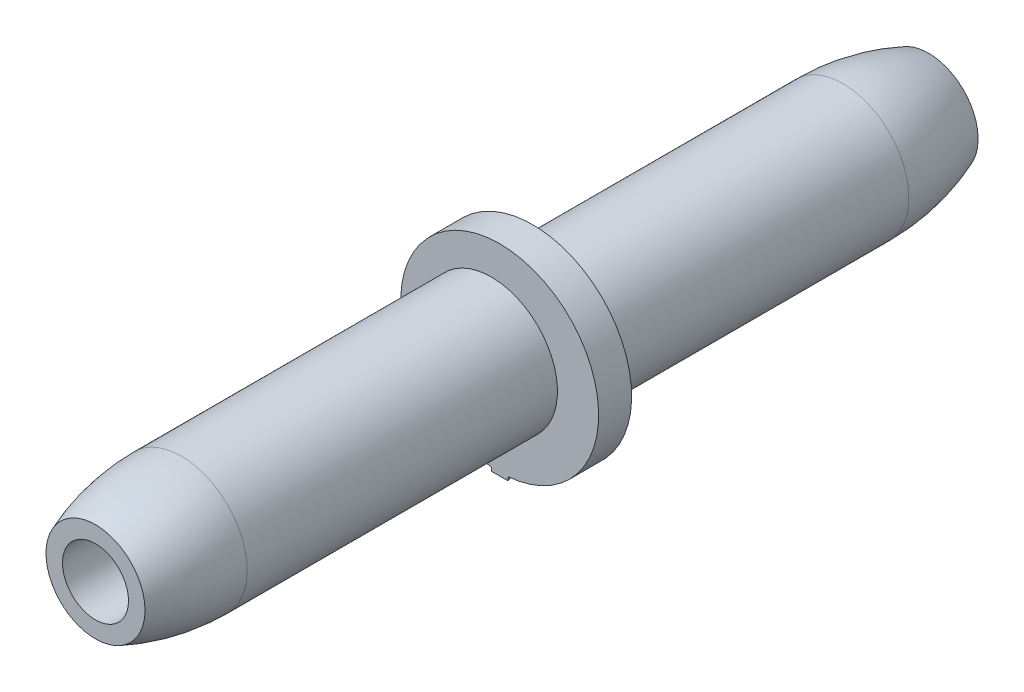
ISO-10303-21;
HEADER;
FILE_DESCRIPTION(('STEP AP214'),'2;1');
FILE_NAME('part.step','',(''),(''),'','','');
FILE_SCHEMA(('AUTOMOTIVE_DESIGN { 1 0 10303 214 1 1 1 1 }'));
ENDSEC;
DATA;
#1=APPLICATION_CONTEXT('core data for automotive mechanical design processes');
#2=APPLICATION_PROTOCOL_DEFINITION('international standard','automotive_design',2000,#1);
#3=PRODUCT_CONTEXT('',#1,'mechanical');
#4=PRODUCT('Part','Part','',(#3));
#5=PRODUCT_RELATED_PRODUCT_CATEGORY('part','',(#4));
#6=PRODUCT_DEFINITION_FORMATION('','',#4);
#7=PRODUCT_DEFINITION_CONTEXT('part definition',#1,'design');
#8=PRODUCT_DEFINITION('design','',#6,#7);
#9=PRODUCT_DEFINITION_SHAPE('','',#8);
#10=(LENGTH_UNIT() NAMED_UNIT(*) SI_UNIT(.MILLI.,.METRE.));
#11=(NAMED_UNIT(*) PLANE_ANGLE_UNIT() SI_UNIT($,.RADIAN.));
#12=(NAMED_UNIT(*) SI_UNIT($,.STERADIAN.) SOLID_ANGLE_UNIT());
#13=UNCERTAINTY_MEASURE_WITH_UNIT(LENGTH_MEASURE(1.E-05),#10,'distance_accuracy_value','');
#14=(GEOMETRIC_REPRESENTATION_CONTEXT(3) GLOBAL_UNCERTAINTY_ASSIGNED_CONTEXT((#13)) GLOBAL_UNIT_ASSIGNED_CONTEXT((#10,
#11,#12)) REPRESENTATION_CONTEXT('',''));
#15=CARTESIAN_POINT('',(0.,0.,0.));
#16=DIRECTION('',(0.,0.,1.));
#17=DIRECTION('',(1.,0.,0.));
#18=AXIS2_PLACEMENT_3D('',#15,#16,#17);
#19=CARTESIAN_POINT('',(-8.293460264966,-3.018472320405,26.));
#20=DIRECTION('',(7.25999732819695E-13,-3.38539235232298E-13,-1.));
#21=DIRECTION('',(0.422618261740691,0.906307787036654,0.));
#22=AXIS2_PLACEMENT_3D('',#19,#20,#21);
#23=PLANE('',#22);
#24=CARTESIAN_POINT('',(-0.5,0.,26.0000000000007));
#25=DIRECTION('',(0.,0.,-1.));
#26=DIRECTION('',(0.,1.,0.));
#27=AXIS2_PLACEMENT_3D('',#24,#25,#26);
#28=CIRCLE('',#27,2.);
#29=CARTESIAN_POINT('',(-0.5,1.99999999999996,26.0000000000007));
#30=VERTEX_POINT('',#29);
#31=EDGE_CURVE('E18',#30,#30,#28,.T.);
#32=ORIENTED_EDGE('',*,*,#31,.F.);
#33=EDGE_LOOP('',(#32));
#34=FACE_BOUND('',#33,.T.);
#35=ADVANCED_FACE('F14',(#34),#23,.F.);
#36=CARTESIAN_POINT('',(-0.5,0.,50.));
#37=DIRECTION('',(0.,0.,-1.));
#38=DIRECTION('',(0.,1.,0.));
#39=AXIS2_PLACEMENT_3D('',#36,#37,#38);
#40=CYLINDRICAL_SURFACE('',#39,2.);
#41=CARTESIAN_POINT('',(-0.5,0.,50.));
#42=DIRECTION('',(0.,0.,-1.));
#43=DIRECTION('',(0.,1.,0.));
#44=AXIS2_PLACEMENT_3D('',#41,#42,#43);
#45=CIRCLE('',#44,2.);
#46=CARTESIAN_POINT('',(-0.5,2.,50.));
#47=VERTEX_POINT('',#46);
#48=EDGE_CURVE('E102',#47,#47,#45,.T.);
#49=ORIENTED_EDGE('',*,*,#48,.F.);
#50=EDGE_LOOP('',(#49));
#51=FACE_BOUND('',#50,.T.);
#52=ORIENTED_EDGE('',*,*,#31,.T.);
#53=EDGE_LOOP('',(#52));
#54=FACE_BOUND('',#53,.T.);
#55=ADVANCED_FACE('F124',(#51,#54),#40,.F.);
#56=CARTESIAN_POINT('',(2.62,-3.124944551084,50.));
#57=DIRECTION('',(0.,0.,1.));
#58=DIRECTION('',(0.,1.,0.));
#59=AXIS2_PLACEMENT_3D('',#56,#57,#58);
#60=PLANE('',#59);
#61=ORIENTED_EDGE('',*,*,#48,.T.);
#62=EDGE_LOOP('',(#61));
#63=FACE_BOUND('',#62,.T.);
#64=CARTESIAN_POINT('',(-0.5,0.,50.));
#65=DIRECTION('',(0.,0.,-1.));
#66=DIRECTION('',(-1.,0.,0.));
#67=AXIS2_PLACEMENT_3D('',#64,#65,#66);
#68=CIRCLE('',#67,2.99999999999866);
#69=CARTESIAN_POINT('',(-3.49999999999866,0.,50.));
#70=VERTEX_POINT('',#69);
#71=EDGE_CURVE('E100',#70,#70,#68,.F.);
#72=ORIENTED_EDGE('',*,*,#71,.T.);
#73=EDGE_LOOP('',(#72));
#74=FACE_BOUND('',#73,.T.);
#75=ADVANCED_FACE('F122',(#63,#74),#60,.T.);
#76=CARTESIAN_POINT('',(9.5,0.,44.80384757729));
#77=DIRECTION('',(0.,-1.,0.));
#78=DIRECTION('',(-0.925721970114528,0.,0.378204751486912));
#79=AXIS2_PLACEMENT_3D('',#76,#77,#78);
#80=CIRCLE('',#79,14.);
#81=TRIMMED_CURVE('',#80,(PARAMETER_VALUE(-0.387337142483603)),
(PARAMETER_VALUE(1.16304960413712)),.T.,.PARAMETER.);
#82=CARTESIAN_POINT('',(-0.5,0.,44.80384757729));
#83=DIRECTION('',(0.,0.,-1.));
#84=AXIS1_PLACEMENT('',#82,#83);
#85=SURFACE_OF_REVOLUTION('',#81,#84);
#86=ORIENTED_EDGE('',*,*,#71,.F.);
#87=EDGE_LOOP('',(#86));
#88=FACE_BOUND('',#87,.T.);
#89=CARTESIAN_POINT('',(-0.5,0.,44.8038475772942));
#90=DIRECTION('',(0.,0.,-1.));
#91=DIRECTION('',(-1.,0.,0.));
#92=AXIS2_PLACEMENT_3D('',#89,#90,#91);
#93=CIRCLE('',#92,4.);
#94=CARTESIAN_POINT('',(-4.5,0.,44.8038475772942));
#95=VERTEX_POINT('',#94);
#96=EDGE_CURVE('E61',#95,#95,#93,.F.);
#97=ORIENTED_EDGE('',*,*,#96,.T.);
#98=EDGE_LOOP('',(#97));
#99=FACE_BOUND('',#98,.T.);
#100=ADVANCED_FACE('F118',(#88,#99),#85,.T.);
#101=CARTESIAN_POINT('',(-0.5238321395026,-6.20000000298,26.2481098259));
#102=DIRECTION('',(0.,-1.,0.));
#103=DIRECTION('',(-0.173648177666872,0.,-0.984807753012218));
#104=AXIS2_PLACEMENT_3D('',#101,#102,#103);
#105=PLANE('',#104);
#106=DIRECTION('',(-0.282166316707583,0.,0.959365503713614));
#107=VECTOR('',#106,1.);
#108=CARTESIAN_POINT('',(-0.250000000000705,-6.2000000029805,25.14999997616));
#109=LINE('',#108,#107);
#110=CARTESIAN_POINT('',(0.,-6.20000000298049,24.2999999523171));
#111=VERTEX_POINT('',#110);
#112=CARTESIAN_POINT('',(-0.499999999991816,-6.20000000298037,25.9999999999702));
#113=VERTEX_POINT('',#112);
#114=EDGE_CURVE('E52',#111,#113,#109,.T.);
#115=ORIENTED_EDGE('',*,*,#114,.F.);
#116=DIRECTION('',(0.282166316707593,0.,0.959365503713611));
#117=VECTOR('',#116,1.);
#118=CARTESIAN_POINT('',(0.250000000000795,-6.20000000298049,25.14999997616));
#119=LINE('',#118,#117);
#120=CARTESIAN_POINT('',(0.500000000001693,-6.20000000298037,26.0000000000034));
#121=VERTEX_POINT('',#120);
#122=EDGE_CURVE('E56',#111,#121,#119,.T.);
#123=ORIENTED_EDGE('',*,*,#122,.T.);
#124=DIRECTION('',(-1.,0.,1.5230872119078E-12));
#125=VECTOR('',#124,1.);
#126=CARTESIAN_POINT('',(0.499999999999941,-6.20000000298,26.0000000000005));
#127=LINE('',#126,#125);
#128=EDGE_CURVE('E46',#121,#113,#127,.T.);
#129=ORIENTED_EDGE('',*,*,#128,.T.);
#130=EDGE_LOOP('',(#115,#123,#129));
#131=FACE_BOUND('',#130,.T.);
#132=ADVANCED_FACE('F54',(#131),#105,.T.);
#133=CARTESIAN_POINT('',(-0.5,0.,44.8038475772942));
#134=DIRECTION('',(0.,0.,-1.));
#135=DIRECTION('',(-1.,0.,0.));
#136=AXIS2_PLACEMENT_3D('',#133,#134,#135);
#137=CYLINDRICAL_SURFACE('',#136,4.);
#138=ORIENTED_EDGE('',*,*,#96,.F.);
#139=EDGE_LOOP('',(#138));
#140=FACE_BOUND('',#139,.T.);
#141=CARTESIAN_POINT('',(-0.5,0.,26.0000000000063));
#142=DIRECTION('',(0.,0.,-1.));
#143=DIRECTION('',(-1.,0.,0.));
#144=AXIS2_PLACEMENT_3D('',#141,#142,#143);
#145=CIRCLE('',#144,4.);
#146=CARTESIAN_POINT('',(-4.5,0.,26.0000000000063));
#147=VERTEX_POINT('',#146);
#148=EDGE_CURVE('E95',#147,#147,#145,.F.);
#149=ORIENTED_EDGE('',*,*,#148,.T.);
#150=EDGE_LOOP('',(#149));
#151=FACE_BOUND('',#150,.T.);
#152=ADVANCED_FACE('F125',(#140,#151),#137,.T.);
#153=CARTESIAN_POINT('',(-0.5187792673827,-6.266553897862,26.06384951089));
#154=DIRECTION('',(-0.959365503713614,0.,-0.282166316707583));
#155=DIRECTION('',(0.,1.,0.));
#156=AXIS2_PLACEMENT_3D('',#153,#154,#155);
#157=PLANE('',#156);
#158=ORIENTED_EDGE('',*,*,#114,.T.);
#159=DIRECTION('',(0.,1.,0.));
#160=VECTOR('',#159,1.);
#161=CARTESIAN_POINT('',(-0.499999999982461,-6.266553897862,25.9999999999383));
#162=LINE('',#161,#160);
#163=CARTESIAN_POINT('',(-0.499999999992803,-5.97914710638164,25.9999999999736));
#164=VERTEX_POINT('',#163);
#165=EDGE_CURVE('E71',#113,#164,#162,.T.);
#166=ORIENTED_EDGE('',*,*,#165,.T.);
#167=CARTESIAN_POINT('',(-0.000100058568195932,-7.76058284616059E-05,24.3003401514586));
#168=DIRECTION('',(-0.959365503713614,0.,-0.282166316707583));
#169=DIRECTION('',(-0.282166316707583,3.34994321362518E-13,0.959365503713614));
#170=AXIS2_PLACEMENT_3D('',#167,#168,#169);
#171=ELLIPSE('',#170,21.2638101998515,5.99993100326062);
#172=CARTESIAN_POINT('',(0.,-6.00000860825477,24.2999999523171));
#173=VERTEX_POINT('',#172);
#174=EDGE_CURVE('E65',#164,#173,#171,.F.);
#175=ORIENTED_EDGE('',*,*,#174,.T.);
#176=DIRECTION('',(0.,-1.,0.));
#177=VECTOR('',#176,1.);
#178=CARTESIAN_POINT('',(0.,-6.089565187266,24.2999999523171));
#179=LINE('',#178,#177);
#180=EDGE_CURVE('E60',#173,#111,#179,.T.);
#181=ORIENTED_EDGE('',*,*,#180,.T.);
#182=EDGE_LOOP('',(#158,#166,#175,#181));
#183=FACE_BOUND('',#182,.T.);
#184=ADVANCED_FACE('F64',(#183),#157,.T.);
#185=CARTESIAN_POINT('',(-0.01877926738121,-5.91257647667,24.23615044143));
#186=DIRECTION('',(-0.959365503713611,0.,0.282166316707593));
#187=DIRECTION('',(0.,-1.,0.));
#188=AXIS2_PLACEMENT_3D('',#185,#186,#187);
#189=PLANE('',#188);
#190=ORIENTED_EDGE('',*,*,#122,.F.);
#191=ORIENTED_EDGE('',*,*,#180,.F.);
#192=CARTESIAN_POINT('',(-0.00010005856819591,-7.76058284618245E-05,24.2996597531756));
#193=DIRECTION('',(-0.959365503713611,0.,0.282166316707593));
#194=DIRECTION('',(0.282166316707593,3.34994321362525E-13,0.959365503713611));
#195=AXIS2_PLACEMENT_3D('',#192,#193,#194);
#196=ELLIPSE('',#195,21.2638101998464,5.99993100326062);
#197=CARTESIAN_POINT('',(0.500000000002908,-5.97913037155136,26.0000000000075));
#198=VERTEX_POINT('',#197);
#199=EDGE_CURVE('E89',#173,#198,#196,.T.);
#200=ORIENTED_EDGE('',*,*,#199,.T.);
#201=DIRECTION('',(0.,-1.,0.));
#202=VECTOR('',#201,1.);
#203=CARTESIAN_POINT('',(0.500000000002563,-5.91257647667,26.0000000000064));
#204=LINE('',#203,#202);
#205=EDGE_CURVE('E69',#198,#121,#204,.T.);
#206=ORIENTED_EDGE('',*,*,#205,.T.);
#207=EDGE_LOOP('',(#190,#191,#200,#206));
#208=FACE_BOUND('',#207,.T.);
#209=ADVANCED_FACE('F68',(#208),#189,.F.);
#210=CARTESIAN_POINT('',(-8.293460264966,-3.018472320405,26.));
#211=DIRECTION('',(7.25999732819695E-13,-3.38539235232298E-13,-1.));
#212=DIRECTION('',(0.422618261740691,0.906307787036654,0.));
#213=AXIS2_PLACEMENT_3D('',#210,#211,#212);
#214=PLANE('',#213);
#215=ORIENTED_EDGE('',*,*,#148,.F.);
#216=EDGE_LOOP('',(#215));
#217=FACE_BOUND('',#216,.T.);
#218=ORIENTED_EDGE('',*,*,#205,.F.);
#219=CARTESIAN_POINT('',(-0.000100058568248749,-7.76058279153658E-05,26.0000000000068));
#220=DIRECTION('',(0.,3.21381995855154E-13,1.));
#221=DIRECTION('',(0.,-1.,3.21381995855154E-13));
#222=AXIS2_PLACEMENT_3D('',#219,#220,#221);
#223=CIRCLE('',#222,5.99993100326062);
#224=EDGE_CURVE('E33',#198,#164,#223,.T.);
#225=ORIENTED_EDGE('',*,*,#224,.T.);
#226=ORIENTED_EDGE('',*,*,#165,.F.);
#227=ORIENTED_EDGE('',*,*,#128,.F.);
#228=EDGE_LOOP('',(#218,#225,#226,#227));
#229=FACE_BOUND('',#228,.T.);
#230=ADVANCED_FACE('F138',(#217,#229),#214,.F.);
#231=CARTESIAN_POINT('',(-0.000100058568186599,-7.76058285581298E-05,24.));
#232=DIRECTION('',(0.,3.21381995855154E-13,1.));
#233=DIRECTION('',(0.,-1.,3.21381995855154E-13));
#234=AXIS2_PLACEMENT_3D('',#231,#232,#233);
#235=CYLINDRICAL_SURFACE('',#234,5.99993100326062);
#236=CARTESIAN_POINT('',(-0.000100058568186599,-7.76058285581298E-05,24.));
#237=DIRECTION('',(0.,3.21381995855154E-13,1.));
#238=DIRECTION('',(0.,-1.,3.21381995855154E-13));
#239=AXIS2_PLACEMENT_3D('',#236,#237,#238);
#240=CIRCLE('',#239,5.99993100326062);
#241=CARTESIAN_POINT('',(-0.000100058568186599,-6.00000860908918,24.0000000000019));
#242=VERTEX_POINT('',#241);
#243=EDGE_CURVE('E82',#242,#242,#240,.F.);
#244=ORIENTED_EDGE('',*,*,#243,.F.);
#245=EDGE_LOOP('',(#244));
#246=FACE_BOUND('',#245,.T.);
#247=ORIENTED_EDGE('',*,*,#224,.F.);
#248=ORIENTED_EDGE('',*,*,#199,.F.);
#249=ORIENTED_EDGE('',*,*,#174,.F.);
#250=EDGE_LOOP('',(#247,#248,#249));
#251=FACE_BOUND('',#250,.T.);
#252=ADVANCED_FACE('F135',(#246,#251),#235,.T.);
#253=CARTESIAN_POINT('',(-8.824691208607,-7.760582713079E-05,24.));
#254=DIRECTION('',(0.,0.,-1.));
#255=DIRECTION('',(0.707106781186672,0.707106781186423,0.));
#256=AXIS2_PLACEMENT_3D('',#253,#254,#255);
#257=PLANE('',#256);
#258=ORIENTED_EDGE('',*,*,#243,.T.);
#259=EDGE_LOOP('',(#258));
#260=FACE_BOUND('',#259,.T.);
#261=CARTESIAN_POINT('',(0.,0.,24.));
#262=DIRECTION('',(0.,0.,-1.));
#263=DIRECTION('',(-1.,0.,0.));
#264=AXIS2_PLACEMENT_3D('',#261,#262,#263);
#265=CIRCLE('',#264,4.);
#266=CARTESIAN_POINT('',(-4.,0.,24.));
#267=VERTEX_POINT('',#266);
#268=EDGE_CURVE('E107',#267,#267,#265,.F.);
#269=ORIENTED_EDGE('',*,*,#268,.T.);
#270=EDGE_LOOP('',(#269));
#271=FACE_BOUND('',#270,.T.);
#272=ADVANCED_FACE('F16',(#260,#271),#257,.T.);
#273=CARTESIAN_POINT('',(-2.08,2.07072019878,21.5));
#274=DIRECTION('',(0.,0.,1.));
#275=DIRECTION('',(0.,-1.,0.));
#276=AXIS2_PLACEMENT_3D('',#273,#274,#275);
#277=PLANE('',#276);
#278=CARTESIAN_POINT('',(0.,0.,21.5));
#279=DIRECTION('',(0.,0.,-1.));
#280=DIRECTION('',(-1.,0.,0.));
#281=AXIS2_PLACEMENT_3D('',#278,#279,#280);
#282=CIRCLE('',#281,2.);
#283=CARTESIAN_POINT('',(-2.,0.,21.5));
#284=VERTEX_POINT('',#283);
#285=EDGE_CURVE('E92',#284,#284,#282,.F.);
#286=ORIENTED_EDGE('',*,*,#285,.F.);
#287=EDGE_LOOP('',(#286));
#288=FACE_BOUND('',#287,.T.);
#289=ADVANCED_FACE('F133',(#288),#277,.F.);
#290=CARTESIAN_POINT('',(0.,0.,21.5));
#291=DIRECTION('',(0.,0.,-1.));
#292=DIRECTION('',(-1.,0.,0.));
#293=AXIS2_PLACEMENT_3D('',#290,#291,#292);
#294=CYLINDRICAL_SURFACE('',#293,2.);
#295=CARTESIAN_POINT('',(0.,0.,-1.00613961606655E-13));
#296=DIRECTION('',(0.,0.,-1.));
#297=DIRECTION('',(-1.,0.,0.));
#298=AXIS2_PLACEMENT_3D('',#295,#296,#297);
#299=CIRCLE('',#298,2.);
#300=CARTESIAN_POINT('',(-2.,0.,-1.00613961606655E-13));
#301=VERTEX_POINT('',#300);
#302=EDGE_CURVE('E85',#301,#301,#299,.T.);
#303=ORIENTED_EDGE('',*,*,#302,.T.);
#304=EDGE_LOOP('',(#303));
#305=FACE_BOUND('',#304,.T.);
#306=ORIENTED_EDGE('',*,*,#285,.T.);
#307=EDGE_LOOP('',(#306));
#308=FACE_BOUND('',#307,.T.);
#309=ADVANCED_FACE('F129',(#305,#308),#294,.F.);
#310=CARTESIAN_POINT('',(-3.12,3.071308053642,-5.719869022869E-13));
#311=DIRECTION('',(0.,0.,1.));
#312=DIRECTION('',(0.,-1.,0.));
#313=AXIS2_PLACEMENT_3D('',#310,#311,#312);
#314=PLANE('',#313);
#315=CARTESIAN_POINT('',(0.,0.,-5.73326108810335E-13));
#316=DIRECTION('',(0.,0.,-1.));
#317=DIRECTION('',(-1.,0.,0.));
#318=AXIS2_PLACEMENT_3D('',#315,#316,#317);
#319=CIRCLE('',#318,2.99999999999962);
#320=CARTESIAN_POINT('',(-2.99999999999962,0.,-5.73326108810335E-13));
#321=VERTEX_POINT('',#320);
#322=EDGE_CURVE('E24',#321,#321,#319,.T.);
#323=ORIENTED_EDGE('',*,*,#322,.T.);
#324=EDGE_LOOP('',(#323));
#325=FACE_BOUND('',#324,.T.);
#326=ORIENTED_EDGE('',*,*,#302,.F.);
#327=EDGE_LOOP('',(#326));
#328=FACE_BOUND('',#327,.T.);
#329=ADVANCED_FACE('F132',(#325,#328),#314,.F.);
#330=CARTESIAN_POINT('',(10.,0.,5.196152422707));
#331=DIRECTION('',(0.,-1.,0.));
#332=DIRECTION('',(-0.999971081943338,0.,0.00760495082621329));
#333=AXIS2_PLACEMENT_3D('',#330,#331,#332);
#334=CIRCLE('',#333,14.);
#335=TRIMMED_CURVE('',#334,(PARAMETER_VALUE(-0.7675883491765)),
(PARAMETER_VALUE(0.782798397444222)),.T.,.PARAMETER.);
#336=CARTESIAN_POINT('',(0.,0.,5.196152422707));
#337=DIRECTION('',(0.,0.,-1.));
#338=AXIS1_PLACEMENT('',#336,#337);
#339=SURFACE_OF_REVOLUTION('',#335,#338);
#340=ORIENTED_EDGE('',*,*,#322,.F.);
#341=EDGE_LOOP('',(#340));
#342=FACE_BOUND('',#341,.T.);
#343=CARTESIAN_POINT('',(0.,0.,5.19615242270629));
#344=DIRECTION('',(0.,0.,-1.));
#345=DIRECTION('',(-1.,0.,0.));
#346=AXIS2_PLACEMENT_3D('',#343,#344,#345);
#347=CIRCLE('',#346,4.);
#348=CARTESIAN_POINT('',(-4.,0.,5.19615242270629));
#349=VERTEX_POINT('',#348);
#350=EDGE_CURVE('E9',#349,#349,#347,.T.);
#351=ORIENTED_EDGE('',*,*,#350,.T.);
#352=EDGE_LOOP('',(#351));
#353=FACE_BOUND('',#352,.T.);
#354=ADVANCED_FACE('F140',(#342,#353),#339,.T.);
#355=CARTESIAN_POINT('',(0.,0.,21.4999999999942));
#356=DIRECTION('',(0.,0.,-1.));
#357=DIRECTION('',(-1.,0.,0.));
#358=AXIS2_PLACEMENT_3D('',#355,#356,#357);
#359=CYLINDRICAL_SURFACE('',#358,4.);
#360=ORIENTED_EDGE('',*,*,#350,.F.);
#361=EDGE_LOOP('',(#360));
#362=FACE_BOUND('',#361,.T.);
#363=ORIENTED_EDGE('',*,*,#268,.F.);
#364=EDGE_LOOP('',(#363));
#365=FACE_BOUND('',#364,.T.);
#366=ADVANCED_FACE('F144',(#362,#365),#359,.T.);
#367=CLOSED_SHELL('',(#35,#55,#75,#100,#132,#152,#184,#209,#230,#252,#272,#289,#309,#329,#354,#366));
#368=MANIFOLD_SOLID_BREP('B1',#367);
#369=ADVANCED_BREP_SHAPE_REPRESENTATION('',(#18,#368),#14);
#370=SHAPE_DEFINITION_REPRESENTATION(#9,#369);
ENDSEC;
END-ISO-10303-21;
